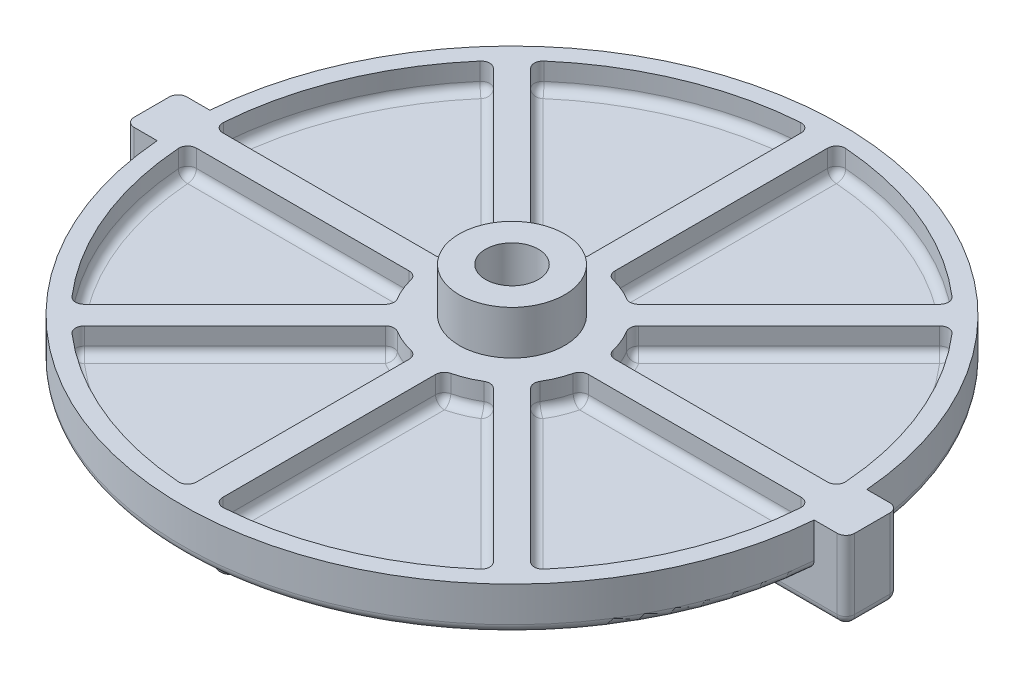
from build123d import *

# Parameters (mm, degrees)
SKETCH1_R                    = 37.5
BOSS_EXTRUDE1_DEPTH          = 5
SHELL1_T                     = -2
SKETCH2_R                    = 9.5
BOSS_EXTRUDE2_DEPTH          = 3
SKETCH3_R                    = 6
BOSS_EXTRUDE3_DEPTH          = 5
RIB1_REACH                   = 55.268
SKETCH4_WALLS_W              = 144.036378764
SKETCH4_WALLS_H              = 3
CIRPATTERN1_COUNT            = 8
BOSS_EXTRUDE4_DEPTH          = 4
SKETCH6_W                    = 82
SKETCH6_H                    = 6
BOSS_EXTRUDE5_DEPTH          = 4
BOSS_EXTRUDE6_DEPTH          = 5
BOSS_EXTRUDE7_DEPTH          = 5
F_6_0_6_DIAMETER_HOLE1_D     = 6
F_6_0_6_DIAMETER_HOLE1_DEPTH = 8
F_6_0_6_DIAMETER_HOLE1_TIP   = 1.802581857
FILLET3_R                    = 1
FILLET4_R                    = 1
FILLET5_R                    = 1
FILLET6_R                    = 1


with BuildPart() as part:
    # Sketch1 → Boss-Extrude1 (new body)
    with BuildSketch(Plane(origin=(0, 0, 0), x_dir=(1, 0, 0), z_dir=(0, 1, 0))):
        with Locations(Location((0, 0, 0), (0, 0, 270))):
            Circle(SKETCH1_R)
    extrude(amount=BOSS_EXTRUDE1_DEPTH)

    # Shell1
    shell1_openings = [part.faces().sort_by_distance(p)[0] for p in [
        (0, 5, 0),
    ]]
    offset(amount=SHELL1_T, openings=shell1_openings, kind=Kind.INTERSECTION)

    # Sketch2 → Boss-Extrude2 (add)
    with BuildSketch(Plane(origin=(0, 2, 0), x_dir=(1, 0, 0), z_dir=(0, 1, 0))):
        with Locations(Location((0, 0, 0), (0, 0, 270))):
            Circle(SKETCH2_R)
    extrude(amount=BOSS_EXTRUDE2_DEPTH)

    # Sketch3 → Boss-Extrude3 (add)
    with BuildSketch(Plane(origin=(0, 5, 0), x_dir=(1, 0, 0), z_dir=(0, 1, 0))):
        with Locations(Location((0, 0, 0), (0, 0, 270))):
            Circle(SKETCH3_R)
    extrude(amount=BOSS_EXTRUDE3_DEPTH)

    # Sketch4 walls → Rib1 (add, up to next)
    with BuildSketch(Plane(origin=(0, 5, 0), x_dir=(1, 0, 0), z_dir=(0, 1, 0)), mode=Mode.PRIVATE) as rib1_sk1:
        with Locations((17.75, 0)):
            Rectangle(SKETCH4_WALLS_W, SKETCH4_WALLS_H)
    rib1_tool1 = extrude(rib1_sk1.sketch, amount=-RIB1_REACH, mode=Mode.PRIVATE) - part.part
    rib1 = rib1_tool1.solids().sort_by_distance((17.75, 5, 0))[0]
    add(rib1)

    # CirPattern1: Rib1 ×8 about axis
    cirpattern1_axis = Axis((0, 0, 0), (0, 1, 0))
    for i in range(1, CIRPATTERN1_COUNT):
        add(rib1.rotate(cirpattern1_axis, i * 360 / CIRPATTERN1_COUNT))

    # Sketch5 → Boss-Extrude4 (add)
    with BuildSketch(Plane.XZ):
        with BuildLine():
            Line((1.5, -17), (1.5, -32))
            ThreePointArc((1.5, -32), (0, -33.5), (-1.5, -32))
            Line((-1.5, -32), (-1.5, -17))
            ThreePointArc((-1.5, -17), (0, -15.5), (1.5, -17))
        make_face()
    boss_extrude4 = extrude(amount=BOSS_EXTRUDE4_DEPTH)

    # Mirror1: Boss-Extrude4 across plane
    add(boss_extrude4.mirror(Plane.XY))

    # Sketch6 → Boss-Extrude5 (add)
    with BuildSketch(Plane.XZ):
        Rectangle(SKETCH6_W, SKETCH6_H)
    extrude(amount=BOSS_EXTRUDE5_DEPTH)

    # Sketch7 → Boss-Extrude6 (add)
    with BuildSketch(Plane(origin=(0, 0, 0), x_dir=(1, 0, 0), z_dir=(0, 1, 0))):
        with BuildLine():
            Line((41, 3), (37.379807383, 3))
            ThreePointArc((37.379807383, 3), (37.5, 0), (37.379807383, -3))
            Line((37.379807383, -3), (41, -3))
            Line((41, -3), (41, 3))
        make_face()
    extrude(amount=BOSS_EXTRUDE6_DEPTH)

    # Sketch8 → Boss-Extrude7 (add)
    with BuildSketch(Plane(origin=(0, 0, 0), x_dir=(1, 0, 0), z_dir=(0, 1, 0))):
        with BuildLine():
            Line((-41, -3), (-37.379807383, -3))
            ThreePointArc((-37.379807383, -3), (-37.5, 0), (-37.379807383, 3))
            Line((-37.379807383, 3), (-41, 3))
            Line((-41, 3), (-41, -3))
        make_face()
    extrude(amount=BOSS_EXTRUDE7_DEPTH)

    # 6.0 _6_ Diameter Hole1
    with Locations(Plane(origin=(0, 10, 0), x_dir=(1, 0, 0), z_dir=(0, 1, 0))):
        with Locations((0, 0)):
            Hole(F_6_0_6_DIAMETER_HOLE1_D / 2, depth=F_6_0_6_DIAMETER_HOLE1_DEPTH)
            with Locations((0, 0, -(F_6_0_6_DIAMETER_HOLE1_DEPTH + F_6_0_6_DIAMETER_HOLE1_TIP / 2))):  # 118° drill point
                Cone(0, F_6_0_6_DIAMETER_HOLE1_D / 2, F_6_0_6_DIAMETER_HOLE1_TIP, mode=Mode.SUBTRACT)

    # Fillet3
    fillet3_edges = [part.edges().sort_by_distance(p)[0] for p in [
        (5.572589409, 3.5, 7.693909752),
        (7.693909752, 3.5, 5.572589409),
        (24.019212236, 3.5, 26.14053258),
        (26.14053258, 3.5, 24.019212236),
        (9.38083152, 3.5, 1.5),
        (1.5, 3.5, 9.38083152),
        (-1.5, 3.5, 35.468295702),
        (9.38083152, 3.5, -1.5),
        (1.5, 3.5, 35.468295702),
        (-1.5, 3.5, 9.38083152),
        (-5.572589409, 3.5, 7.693909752),
        (-26.14053258, 3.5, 24.019212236),
        (-24.019212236, 3.5, 26.14053258),
        (-7.693909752, 3.5, 5.572589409),
        (-9.38083152, 3.5, 1.5),
        (-35.468295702, 3.5, -1.5),
        (-35.468295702, 3.5, 1.5),
        (-9.38083152, 3.5, -1.5),
        (-7.693909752, 3.5, -5.572589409),
        (-24.019212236, 3.5, -26.14053258),
        (-26.14053258, 3.5, -24.019212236),
        (-5.572589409, 3.5, -7.693909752),
        (35.468295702, 3.5, 1.5),
        (-1.5, 3.5, -9.38083152),
        (1.5, 3.5, -35.468295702),
        (-1.5, 3.5, -35.468295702),
        (1.5, 3.5, -9.38083152),
        (35.468295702, 3.5, -1.5),
        (5.572589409, 3.5, -7.693909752),
        (26.14053258, 3.5, -24.019212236),
        (24.019212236, 3.5, -26.14053258),
        (7.693909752, 3.5, -5.572589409),
    ]]
    fillet(fillet3_edges, radius=FILLET3_R)

    # Fillet4
    fillet4_edges = [part.edges().sort_by_distance(p)[0] for p in [
        (-16.831736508, 2, -14.710416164),
        (-32.797723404, 2, -13.585261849),
        (-22.303670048, 2, -1.5),
        (-8.776855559, 2, -3.635492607),
        (-7.986085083, 2, -5.563248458),
        (-9.580825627, 2, -1.713204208),
        (-35.141579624, 2, -1.818994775),
        (-26.135072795, 2, -23.562625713),
        (-1.5, 2, -22.303670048),
        (-13.585261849, 2, -32.797723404),
        (-14.710416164, 2, -16.831736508),
        (-3.635492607, 2, -8.776855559),
        (-1.713204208, 2, -9.580825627),
        (-5.563248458, 2, -7.986085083),
        (-23.562625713, 2, -26.135072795),
        (-1.818994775, 2, -35.141579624),
        (32.797723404, 2, 13.585261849),
        (16.831736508, 2, 14.710416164),
        (22.303670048, 2, 1.5),
        (8.776855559, 2, 3.635492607),
        (26.135072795, 2, 23.562625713),
        (7.986085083, 2, 5.563248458),
        (9.580825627, 2, 1.713204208),
        (35.141579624, 2, 1.818994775),
        (13.585261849, 2, 32.797723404),
        (1.5, 2, 22.303670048),
        (14.710416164, 2, 16.831736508),
        (3.635492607, 2, 8.776855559),
        (1.818994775, 2, 35.141579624),
        (1.713204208, 2, 9.580825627),
        (5.563248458, 2, 7.986085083),
        (23.562625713, 2, 26.135072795),
        (-13.585261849, 2, 32.797723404),
        (-14.710416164, 2, 16.831736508),
        (-1.5, 2, 22.303670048),
        (-3.635492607, 2, 8.776855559),
        (-23.562625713, 2, 26.135072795),
        (-5.563248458, 2, 7.986085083),
        (-1.713204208, 2, 9.580825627),
        (-1.818994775, 2, 35.141579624),
        (22.303670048, 2, -1.5),
        (32.797723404, 2, -13.585261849),
        (16.831736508, 2, -14.710416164),
        (8.776855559, 2, -3.635492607),
        (9.580825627, 2, -1.713204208),
        (7.986085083, 2, -5.563248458),
        (26.135072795, 2, -23.562625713),
        (35.141579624, 2, -1.818994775),
        (-16.831736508, 2, 14.710416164),
        (-22.303670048, 2, 1.5),
        (-32.797723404, 2, 13.585261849),
        (-8.776855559, 2, 3.635492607),
        (-26.135072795, 2, 23.562625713),
        (-35.141579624, 2, 1.818994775),
        (-9.580825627, 2, 1.713204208),
        (-7.986085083, 2, 5.563248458),
        (14.710416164, 2, -16.831736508),
        (13.585261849, 2, -32.797723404),
        (1.5, 2, -22.303670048),
        (3.635492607, 2, -8.776855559),
        (5.563248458, 2, -7.986085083),
        (1.713204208, 2, -9.580825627),
        (1.818994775, 2, -35.141579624),
        (23.562625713, 2, -26.135072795),
    ]]
    fillet(fillet4_edges, radius=FILLET4_R)

    # Fillet5
    fillet5_edges = [part.edges().sort_by_distance(p)[0] for p in [
        (-41, -4, 0),
        (41, -4, 0),
    ]]
    fillet(fillet5_edges, radius=FILLET5_R)

    # Fillet6
    fillet6_edges = [part.edges().sort_by_distance(p)[0] for p in [
        (0, -4, 3),
        (0, -4, -3),
        (41, 1, 3),
        (-41, 1, 3),
        (-40.707106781, -3.707106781, 3),
        (40.707106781, -3.707106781, 3),
        (41, 1, -3),
        (-41, 1, -3),
        (-40.707106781, -3.707106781, -3),
        (40.707106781, -3.707106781, -3),
        (0, 0, -15.5),
        (-1.5, 0, -24.5),
        (0, 0, -33.5),
        (1.5, 0, -24.5),
        (0, -4, -15.5),
        (-1.5, -4, -24.5),
        (0, -4, -33.5),
        (1.5, -4, -24.5),
        (0, -4, 15.5),
        (1.5, -4, 24.5),
        (0, -4, 33.5),
        (-1.5, -4, 24.5),
        (0, 0, 15.5),
        (-1.5, 0, 24.5),
        (0, 0, 33.5),
        (1.5, 0, 24.5),
        (0, 0, -37.5),
        (0, 0, 37.5),
    ]]
    fillet(fillet6_edges, radius=FILLET6_R)


solid = part.part
